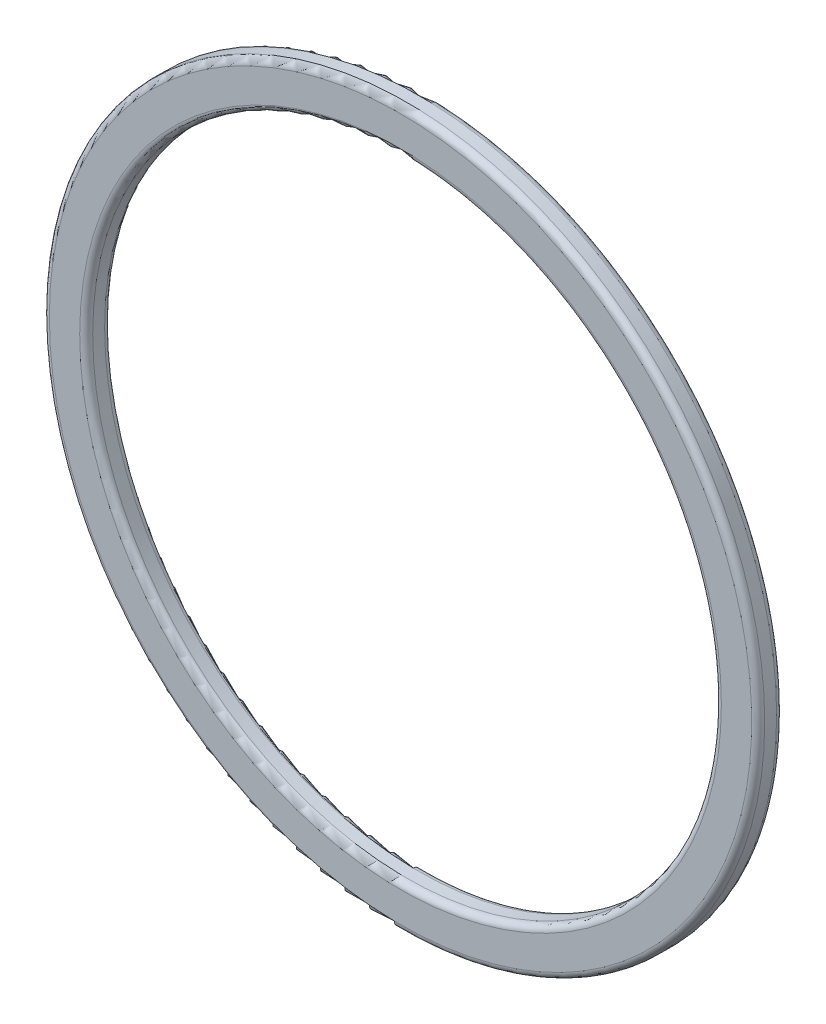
from build123d import *


with BuildPart() as part:
    # Balayage1: sweep along a path in Esquisse1
    with BuildLine(Plane.XY) as balayage1_path:
        CenterArc((0, 0), 29, 0, 360)
    # Esquisse2 → Balayage1 (sweep)
    with BuildSketch(Plane(origin=(0, 0, 0), x_dir=(1, 0, 0), z_dir=(0, 1, 0))):
        with BuildLine():
            Line((-32.4, 1.013095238), (-29.6, 1.013095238))
            ThreePointArc((-29.6, 1.013095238), (-29.175735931, 0.837359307), (-29, 0.413095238))
            Line((-29, 0.413095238), (-29, -0.686904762))
            ThreePointArc((-29, -0.686904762), (-29.175735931, -1.111168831), (-29.6, -1.286904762))
            Line((-29.6, -1.286904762), (-32.4, -1.286904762))
            ThreePointArc((-32.4, -1.286904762), (-32.824264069, -1.111168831), (-33, -0.686904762))
            Line((-33, -0.686904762), (-33, 0.413095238))
            ThreePointArc((-33, 0.413095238), (-32.824264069, 0.837359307), (-32.4, 1.013095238))
        make_face()
    sweep(path=balayage1_path.line)


solid = part.part
